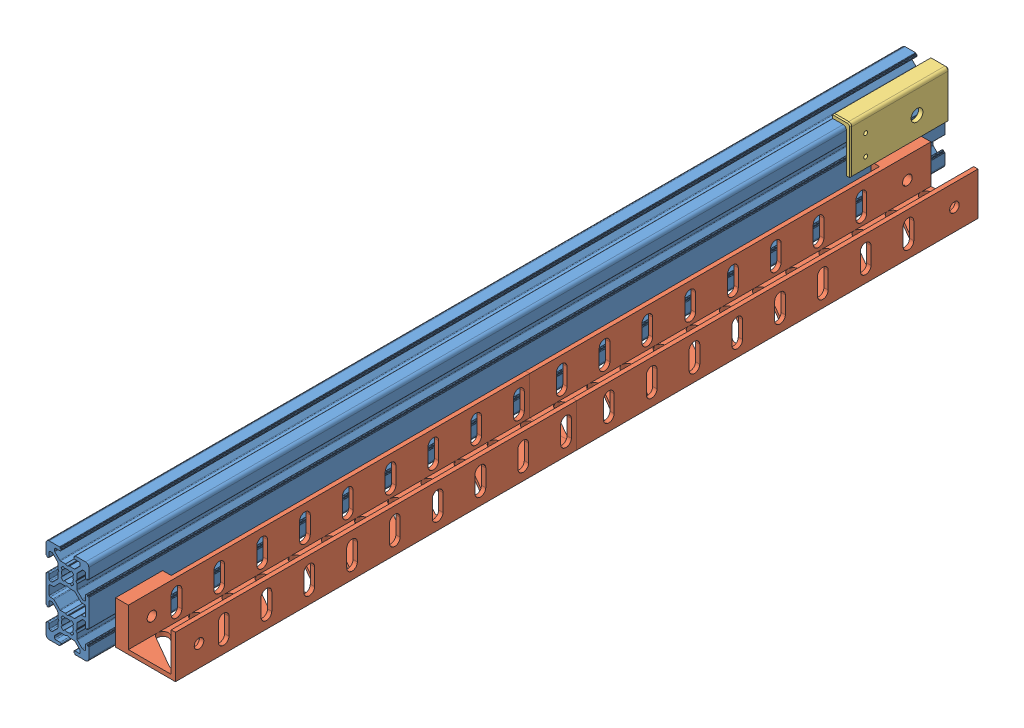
SolidWorks assembly Assem1.SLDASM, configuration Default (file format 15000). Lengths in mm.
Overall size (48 42 400).
3 component instances, 3 part files, 9 mates.
Components (placement in the parent):
- al-profil-20x40-drazka-6-1: al-profil-20x40-drazka-6.SLDPRT [Default] at (-20 26.3 0) x (0 -1 0) z (0 0 1) size (40 20 400)
- Holder-1: Holder.SLDPRT [Default] at (28 0 387.5) x (0 0 -1) z (1 0 0) size (375 20 28)
- Limit Switch Holder-1: Limit Switch Holder.SLDPRT [Default] at (0 20 0) size (8.5 22 46)
Mates (geometry in assembly coordinates):
- Coincident7: coincident anti-aligned: plane of al-profil-20x40-drazka-6-1 through (-1.5 0 0) normal (0 -1 0)
- Coincident8: coincident aligned: plane of al-profil-20x40-drazka-6-1 through (0 26.3 0) normal (1 0 0)
- Coincident9: coincident anti-aligned: plane of al-profil-20x40-drazka-6-1 through (-10 20 0) normal (0 0 -1)
- Parallel3: parallel aligned: plane of al-profil-20x40-drazka-6-1 through (-6.3 40 0) normal (0 1 0); plane of Holder-1 through (4 20 12.5) normal (0 1 0)
- Distance2: distance = 4 mm anti-aligned: plane of Holder-1 through (4 0 12.5) normal (-1 0 0); plane of al-profil-20x40-drazka-6-1 through (0 26.3 0) normal (1 0 0)
- Distance3: distance = 12.5 mm aligned: plane of al-profil-20x40-drazka-6-1 through (-10 20 400) normal (0 0 1); plane of Holder-1 through (28 0 387.5) normal (0 0 1)
- Coincident17: coincident aligned: plane of al-profil-20x40-drazka-6-1 through (-1.5 0 0) normal (0 -1 0); plane of Holder-1 through (28 0 12.5) normal (0 -1 0)
- Coincident19: coincident aligned: plane of al-profil-20x40-drazka-6-1 through (-10 20 0) normal (0 0 -1); plane of Part2^Assem1-1 through (2 40 0) normal (0 0 -1)
- Coincident21: coincident anti-aligned: plane of al-profil-20x40-drazka-6-1 through (0 26.3 0) normal (1 0 0); plane of Part2^Assem1-1 through (0 20 0) normal (-1 0 0)
